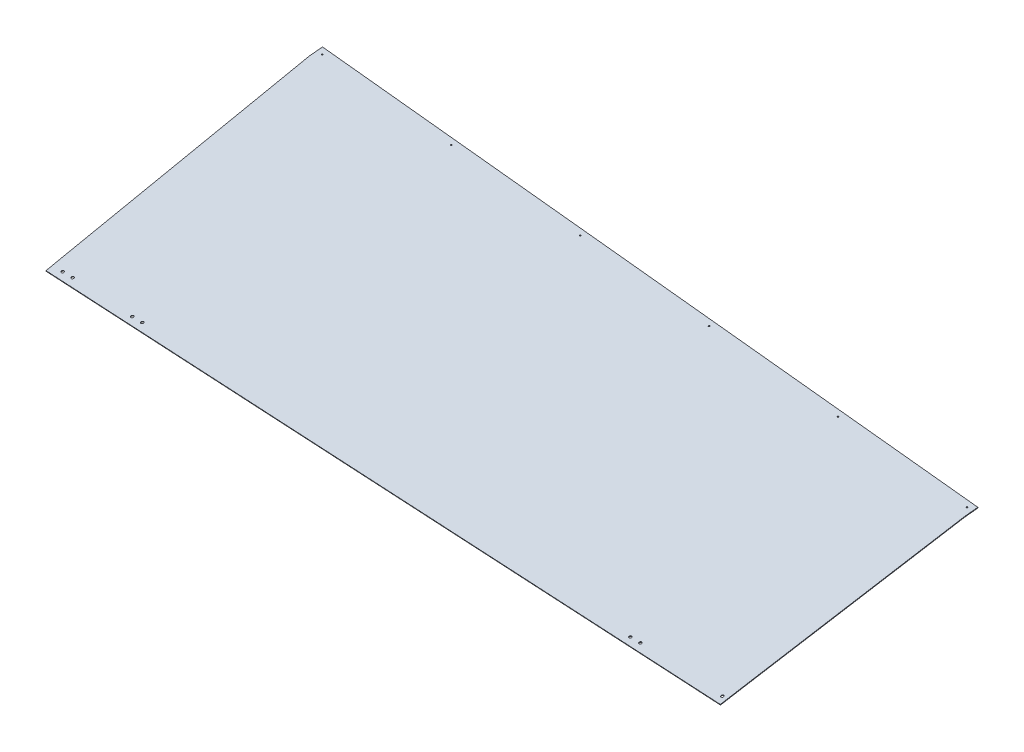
ISO-10303-21;
HEADER;
FILE_DESCRIPTION(('STEP AP214'),'2;1');
FILE_NAME('part.step','',(''),(''),'','','');
FILE_SCHEMA(('AUTOMOTIVE_DESIGN { 1 0 10303 214 1 1 1 1 }'));
ENDSEC;
DATA;
#1=APPLICATION_CONTEXT('core data for automotive mechanical design processes');
#2=APPLICATION_PROTOCOL_DEFINITION('international standard','automotive_design',2000,#1);
#3=PRODUCT_CONTEXT('',#1,'mechanical');
#4=PRODUCT('Part','Part','',(#3));
#5=PRODUCT_RELATED_PRODUCT_CATEGORY('part','',(#4));
#6=PRODUCT_DEFINITION_FORMATION('','',#4);
#7=PRODUCT_DEFINITION_CONTEXT('part definition',#1,'design');
#8=PRODUCT_DEFINITION('design','',#6,#7);
#9=PRODUCT_DEFINITION_SHAPE('','',#8);
#10=(LENGTH_UNIT() NAMED_UNIT(*) SI_UNIT(.MILLI.,.METRE.));
#11=(NAMED_UNIT(*) PLANE_ANGLE_UNIT() SI_UNIT($,.RADIAN.));
#12=(NAMED_UNIT(*) SI_UNIT($,.STERADIAN.) SOLID_ANGLE_UNIT());
#13=UNCERTAINTY_MEASURE_WITH_UNIT(LENGTH_MEASURE(1.E-05),#10,'distance_accuracy_value','');
#14=(GEOMETRIC_REPRESENTATION_CONTEXT(3) GLOBAL_UNCERTAINTY_ASSIGNED_CONTEXT((#13)) GLOBAL_UNIT_ASSIGNED_CONTEXT((#10,
#11,#12)) REPRESENTATION_CONTEXT('',''));
#15=CARTESIAN_POINT('',(0.,0.,0.));
#16=DIRECTION('',(0.,0.,1.));
#17=DIRECTION('',(1.,0.,0.));
#18=AXIS2_PLACEMENT_3D('',#15,#16,#17);
#19=CARTESIAN_POINT('',(6.04000777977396,-300.572395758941,-61.7927019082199));
#20=DIRECTION('',(-0.0196795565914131,0.979325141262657,0.201333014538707));
#21=DIRECTION('',(0.,-0.201372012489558,0.979514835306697));
#22=AXIS2_PLACEMENT_3D('',#19,#20,#21);
#23=PLANE('',#22);
#24=DIRECTION('',(0.,-0.201372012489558,0.979514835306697));
#25=VECTOR('',#24,1.);
#26=CARTESIAN_POINT('',(-2552.66800891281,-349.904673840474,-71.9346004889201));
#27=LINE('',#26,#25);
#28=CARTESIAN_POINT('',(-2552.66800891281,-38.36786149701,-1587.31365273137));
#29=VERTEX_POINT('',#28);
#30=CARTESIAN_POINT('',(-2552.66800891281,-161.607651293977,-987.849998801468));
#31=VERTEX_POINT('',#30);
#32=EDGE_CURVE('E168',#29,#31,#27,.T.);
#33=ORIENTED_EDGE('',*,*,#32,.F.);
#34=DIRECTION('',(-0.095271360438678,-0.202292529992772,0.974679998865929));
#35=VECTOR('',#34,1.);
#36=CARTESIAN_POINT('',(-2552.47657041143,-37.9613743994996,-1589.27217707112));
#37=LINE('',#36,#35);
#38=CARTESIAN_POINT('',(-2549.70400794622,-32.0743095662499,-1617.63706204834));
#39=VERTEX_POINT('',#38);
#40=EDGE_CURVE('E173',#39,#29,#37,.T.);
#41=ORIENTED_EDGE('',*,*,#40,.F.);
#42=DIRECTION('',(-0.995256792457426,0.,-0.0972826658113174));
#43=VECTOR('',#42,1.);
#44=CARTESIAN_POINT('',(-2549.86215064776,-32.0743095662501,-1617.65251991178));
#45=LINE('',#44,#43);
#46=CARTESIAN_POINT('',(-750.604234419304,-32.07430956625,-1441.78172164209));
#47=VERTEX_POINT('',#46);
#48=EDGE_CURVE('E688',#47,#39,#45,.T.);
#49=ORIENTED_EDGE('',*,*,#48,.F.);
#50=DIRECTION('',(0.0952713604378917,0.202292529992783,-0.974679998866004));
#51=VECTOR('',#50,1.);
#52=CARTESIAN_POINT('',(-753.44208377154,-38.1000000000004,-1412.7489148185));
#53=LINE('',#52,#51);
#54=CARTESIAN_POINT('',(-753.44208377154,-38.1000000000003,-1412.7489148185));
#55=VERTEX_POINT('',#54);
#56=EDGE_CURVE('E194',#55,#47,#53,.T.);
#57=ORIENTED_EDGE('',*,*,#56,.F.);
#58=DIRECTION('',(0.0340234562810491,0.201911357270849,-0.978812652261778));
#59=VECTOR('',#58,1.);
#60=CARTESIAN_POINT('',(-799.356363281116,-310.577152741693,-91.8520214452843));
#61=LINE('',#60,#59);
#62=CARTESIAN_POINT('',(-771.320620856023,-144.199734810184,-898.405570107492));
#63=VERTEX_POINT('',#62);
#64=EDGE_CURVE('E179',#63,#55,#61,.T.);
#65=ORIENTED_EDGE('',*,*,#64,.F.);
#66=DIRECTION('',(0.02768603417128,0.201828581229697,-0.979029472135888));
#67=VECTOR('',#66,1.);
#68=CARTESIAN_POINT('',(-771.337947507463,-144.326044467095,-897.79286760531));
#69=LINE('',#68,#67);
#70=CARTESIAN_POINT('',(-771.337947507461,-144.326044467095,-897.79286760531));
#71=VERTEX_POINT('',#70);
#72=EDGE_CURVE('E144',#71,#63,#69,.T.);
#73=ORIENTED_EDGE('',*,*,#72,.F.);
#74=DIRECTION('',(0.0312390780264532,0.201875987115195,-0.978912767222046));
#75=VECTOR('',#74,1.);
#76=CARTESIAN_POINT('',(-798.724837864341,-321.308077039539,-39.5928720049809));
#77=LINE('',#76,#75);
#78=CARTESIAN_POINT('',(-773.600317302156,-158.946134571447,-826.898884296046));
#79=VERTEX_POINT('',#78);
#80=EDGE_CURVE('E609',#79,#71,#77,.T.);
#81=ORIENTED_EDGE('',*,*,#80,.F.);
#82=DIRECTION('',(-0.998109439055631,-0.00751635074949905,-0.0610004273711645));
#83=VECTOR('',#82,1.);
#84=CARTESIAN_POINT('',(2449.4820662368,-134.674429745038,-629.917075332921));
#85=LINE('',#84,#83);
#86=CARTESIAN_POINT('',(-2552.49538074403,-172.342260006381,-935.617783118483));
#87=VERTEX_POINT('',#86);
#88=EDGE_CURVE('E716',#79,#87,#85,.T.);
#89=ORIENTED_EDGE('',*,*,#88,.T.);
#90=DIRECTION('',(0.0034465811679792,-0.201304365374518,0.979522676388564));
#91=VECTOR('',#90,1.);
#92=CARTESIAN_POINT('',(-2549.25021130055,-361.882776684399,-13.336570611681));
#93=LINE('',#92,#91);
#94=CARTESIAN_POINT('',(-2552.6770094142,-161.733879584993,-987.23687822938));
#95=VERTEX_POINT('',#94);
#96=EDGE_CURVE('E805',#95,#87,#93,.T.);
#97=ORIENTED_EDGE('',*,*,#96,.F.);
#98=DIRECTION('',(-0.0143767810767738,-0.201628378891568,0.979356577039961));
#99=VECTOR('',#98,1.);
#100=CARTESIAN_POINT('',(-2552.66800891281,-161.607651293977,-987.849998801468));
#101=LINE('',#100,#99);
#102=EDGE_CURVE('E178',#31,#95,#101,.T.);
#103=ORIENTED_EDGE('',*,*,#102,.F.);
#104=EDGE_LOOP('',(#33,#41,#49,#57,#65,#73,#81,#89,#97,#103));
#105=FACE_BOUND('',#104,.T.);
#106=CARTESIAN_POINT('',(-2536.35628306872,-34.6434246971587,-1603.83566761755));
#107=DIRECTION('',(0.019679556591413,-0.979325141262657,-0.201333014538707));
#108=DIRECTION('',(-0.995256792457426,0.,-0.0972826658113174));
#109=AXIS2_PLACEMENT_3D('',#106,#107,#108);
#110=CIRCLE('',#109,1.58749999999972);
#111=CARTESIAN_POINT('',(-2537.93625322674,-34.6434246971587,-1603.99010384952));
#112=VERTEX_POINT('',#111);
#113=EDGE_CURVE('E669',#112,#112,#110,.T.);
#114=ORIENTED_EDGE('',*,*,#113,.F.);
#115=EDGE_LOOP('',(#114));
#116=FACE_BOUND('',#115,.T.);
#117=CARTESIAN_POINT('',(-2182.44296767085,-34.6434246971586,-1569.24195165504));
#118=DIRECTION('',(0.019679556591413,-0.979325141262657,-0.201333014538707));
#119=DIRECTION('',(-0.995256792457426,0.,-0.0972826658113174));
#120=AXIS2_PLACEMENT_3D('',#117,#118,#119);
#121=CIRCLE('',#120,1.58750000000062);
#122=CARTESIAN_POINT('',(-2184.02293782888,-34.6434246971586,-1569.39638788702));
#123=VERTEX_POINT('',#122);
#124=EDGE_CURVE('E672',#123,#123,#121,.T.);
#125=ORIENTED_EDGE('',*,*,#124,.F.);
#126=EDGE_LOOP('',(#125));
#127=FACE_BOUND('',#126,.T.);
#128=CARTESIAN_POINT('',(-1828.52965227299,-34.6434246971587,-1534.64823569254));
#129=DIRECTION('',(0.019679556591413,-0.979325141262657,-0.201333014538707));
#130=DIRECTION('',(-0.995256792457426,0.,-0.0972826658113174));
#131=AXIS2_PLACEMENT_3D('',#128,#129,#130);
#132=CIRCLE('',#131,1.58750000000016);
#133=CARTESIAN_POINT('',(-1830.10962243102,-34.6434246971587,-1534.80267192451));
#134=VERTEX_POINT('',#133);
#135=EDGE_CURVE('E675',#134,#134,#132,.T.);
#136=ORIENTED_EDGE('',*,*,#135,.F.);
#137=EDGE_LOOP('',(#136));
#138=FACE_BOUND('',#137,.T.);
#139=CARTESIAN_POINT('',(-1474.61633687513,-34.6434246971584,-1500.05451973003));
#140=DIRECTION('',(0.019679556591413,-0.979325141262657,-0.201333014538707));
#141=DIRECTION('',(-0.995256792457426,0.,-0.0972826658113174));
#142=AXIS2_PLACEMENT_3D('',#139,#140,#141);
#143=CIRCLE('',#142,1.58749999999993);
#144=CARTESIAN_POINT('',(-1476.19630703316,-34.6434246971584,-1500.20895596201));
#145=VERTEX_POINT('',#144);
#146=EDGE_CURVE('E678',#145,#145,#143,.T.);
#147=ORIENTED_EDGE('',*,*,#146,.F.);
#148=EDGE_LOOP('',(#147));
#149=FACE_BOUND('',#148,.T.);
#150=CARTESIAN_POINT('',(-1120.70302147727,-34.6434246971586,-1465.46080376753));
#151=DIRECTION('',(0.019679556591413,-0.979325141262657,-0.201333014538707));
#152=DIRECTION('',(-0.995256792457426,0.,-0.0972826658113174));
#153=AXIS2_PLACEMENT_3D('',#150,#151,#152);
#154=CIRCLE('',#153,1.58749999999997);
#155=CARTESIAN_POINT('',(-1122.2829916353,-34.6434246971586,-1465.6152399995));
#156=VERTEX_POINT('',#155);
#157=EDGE_CURVE('E681',#156,#156,#154,.T.);
#158=ORIENTED_EDGE('',*,*,#157,.F.);
#159=EDGE_LOOP('',(#158));
#160=FACE_BOUND('',#159,.T.);
#161=CARTESIAN_POINT('',(-766.789706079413,-34.6434246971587,-1430.86708780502));
#162=DIRECTION('',(0.019679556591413,-0.979325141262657,-0.201333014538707));
#163=DIRECTION('',(-0.995256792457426,0.,-0.0972826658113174));
#164=AXIS2_PLACEMENT_3D('',#161,#162,#163);
#165=CIRCLE('',#164,1.58749999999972);
#166=CARTESIAN_POINT('',(-768.369676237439,-34.6434246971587,-1431.021524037));
#167=VERTEX_POINT('',#166);
#168=EDGE_CURVE('E684',#167,#167,#165,.T.);
#169=ORIENTED_EDGE('',*,*,#168,.F.);
#170=EDGE_LOOP('',(#169));
#171=FACE_BOUND('',#170,.T.);
#172=CARTESIAN_POINT('',(-2526.0839190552,-168.78263574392,-950.350904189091));
#173=DIRECTION('',(0.0196795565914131,-0.979325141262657,-0.201333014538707));
#174=DIRECTION('',(-0.00344658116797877,0.201304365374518,-0.979522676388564));
#175=AXIS2_PLACEMENT_3D('',#172,#173,#174);
#176=CIRCLE('',#175,3.17500000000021);
#177=CARTESIAN_POINT('',(-2526.09486195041,-168.143494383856,-953.460888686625));
#178=VERTEX_POINT('',#177);
#179=EDGE_CURVE('E720',#178,#178,#176,.T.);
#180=ORIENTED_EDGE('',*,*,#179,.F.);
#181=EDGE_LOOP('',(#180));
#182=FACE_BOUND('',#181,.T.);
#183=CARTESIAN_POINT('',(-2500.69926572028,-168.439778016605,-949.537378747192));
#184=DIRECTION('',(0.0196795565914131,-0.979325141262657,-0.201333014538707));
#185=DIRECTION('',(-0.00344658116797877,0.201304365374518,-0.979522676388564));
#186=AXIS2_PLACEMENT_3D('',#183,#184,#185);
#187=CIRCLE('',#186,3.17500000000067);
#188=CARTESIAN_POINT('',(-2500.71020861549,-167.80063665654,-952.647363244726));
#189=VERTEX_POINT('',#188);
#190=EDGE_CURVE('E730',#189,#189,#187,.T.);
#191=ORIENTED_EDGE('',*,*,#190,.F.);
#192=EDGE_LOOP('',(#191));
#193=FACE_BOUND('',#192,.T.);
#194=CARTESIAN_POINT('',(-2342.20762643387,-167.397941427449,-939.113115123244));
#195=DIRECTION('',(0.0196795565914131,-0.979325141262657,-0.201333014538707));
#196=DIRECTION('',(-0.00344658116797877,0.201304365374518,-0.979522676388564));
#197=AXIS2_PLACEMENT_3D('',#194,#195,#196);
#198=CIRCLE('',#197,3.17500000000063);
#199=CARTESIAN_POINT('',(-2342.21856932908,-166.758800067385,-942.223099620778));
#200=VERTEX_POINT('',#199);
#201=EDGE_CURVE('E736',#200,#200,#198,.T.);
#202=ORIENTED_EDGE('',*,*,#201,.F.);
#203=EDGE_LOOP('',(#202));
#204=FACE_BOUND('',#203,.T.);
#205=CARTESIAN_POINT('',(-2316.82297309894,-167.055083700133,-938.299589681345));
#206=DIRECTION('',(0.0196795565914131,-0.979325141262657,-0.201333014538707));
#207=DIRECTION('',(-0.00344658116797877,0.201304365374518,-0.979522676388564));
#208=AXIS2_PLACEMENT_3D('',#205,#206,#207);
#209=CIRCLE('',#208,3.17500000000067);
#210=CARTESIAN_POINT('',(-2316.83391599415,-166.415942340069,-941.409574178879));
#211=VERTEX_POINT('',#210);
#212=EDGE_CURVE('E742',#211,#211,#209,.T.);
#213=ORIENTED_EDGE('',*,*,#212,.F.);
#214=EDGE_LOOP('',(#213));
#215=FACE_BOUND('',#214,.T.);
#216=CARTESIAN_POINT('',(-1028.1261903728,-157.502151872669,-858.801674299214));
#217=DIRECTION('',(0.0196795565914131,-0.979325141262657,-0.201333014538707));
#218=DIRECTION('',(-0.00344658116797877,0.201304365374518,-0.979522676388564));
#219=AXIS2_PLACEMENT_3D('',#216,#217,#218);
#220=CIRCLE('',#219,3.17500000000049);
#221=CARTESIAN_POINT('',(-1028.137133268,-156.863010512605,-861.911658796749));
#222=VERTEX_POINT('',#221);
#223=EDGE_CURVE('E748',#222,#222,#220,.T.);
#224=ORIENTED_EDGE('',*,*,#223,.F.);
#225=EDGE_LOOP('',(#224));
#226=FACE_BOUND('',#225,.T.);
#227=CARTESIAN_POINT('',(-1002.74153703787,-157.159294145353,-857.988148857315));
#228=DIRECTION('',(0.0196795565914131,-0.979325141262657,-0.201333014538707));
#229=DIRECTION('',(-0.00344658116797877,0.201304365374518,-0.979522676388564));
#230=AXIS2_PLACEMENT_3D('',#227,#228,#229);
#231=CIRCLE('',#230,3.17500000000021);
#232=CARTESIAN_POINT('',(-1002.75247993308,-156.520152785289,-861.098133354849));
#233=VERTEX_POINT('',#232);
#234=EDGE_CURVE('E754',#233,#233,#231,.T.);
#235=ORIENTED_EDGE('',*,*,#234,.F.);
#236=EDGE_LOOP('',(#235));
#237=FACE_BOUND('',#236,.T.);
#238=CARTESIAN_POINT('',(-785.599700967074,-155.675787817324,-843.97941803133));
#239=DIRECTION('',(0.0196795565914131,-0.979325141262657,-0.201333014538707));
#240=DIRECTION('',(-0.00344658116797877,0.201304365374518,-0.979522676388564));
#241=AXIS2_PLACEMENT_3D('',#238,#239,#240);
#242=CIRCLE('',#241,3.17500000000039);
#243=CARTESIAN_POINT('',(-785.610643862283,-155.03664645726,-847.089402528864));
#244=VERTEX_POINT('',#243);
#245=EDGE_CURVE('E760',#244,#244,#242,.T.);
#246=ORIENTED_EDGE('',*,*,#245,.F.);
#247=EDGE_LOOP('',(#246));
#248=FACE_BOUND('',#247,.T.);
#249=ADVANCED_FACE('F127',(#105,#116,#127,#138,#149,#160,#171,#182,#193,#204,#215,#226,#237,
#248),#23,.F.);
#250=CARTESIAN_POINT('',(-875.350545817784,3471.16524588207,685.611524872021));
#251=DIRECTION('',(-0.999227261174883,-0.0124125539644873,-0.037293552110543));
#252=DIRECTION('',(-0.0372964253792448,0.,0.999304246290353));
#253=AXIS2_PLACEMENT_3D('',#250,#251,#252);
#254=PLANE('',#253);
#255=CARTESIAN_POINT('',(-771.320620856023,-144.199734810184,-898.405570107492));
#256=DIRECTION('',(-0.019679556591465,0.979325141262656,0.201333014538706));
#257=VECTOR('',#256,1.);
#258=LINE('',#255,#257);
#259=CARTESIAN_POINT('',(-771.352611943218,-142.607743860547,-898.078283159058));
#260=VERTEX_POINT('',#259);
#261=EDGE_CURVE('E13',#63,#260,#258,.T.);
#262=ORIENTED_EDGE('',*,*,#261,.F.);
#263=ORIENTED_EDGE('',*,*,#64,.T.);
#264=DIRECTION('',(-0.0196795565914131,0.979325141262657,0.201333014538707));
#265=VECTOR('',#264,1.);
#266=CARTESIAN_POINT('',(-753.458079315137,-37.304004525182,-1412.58527134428));
#267=LINE('',#266,#265);
#268=CARTESIAN_POINT('',(-753.474074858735,-36.5080090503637,-1412.42162787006));
#269=VERTEX_POINT('',#268);
#270=EDGE_CURVE('E186',#55,#269,#267,.T.);
#271=ORIENTED_EDGE('',*,*,#270,.T.);
#272=DIRECTION('',(0.0340234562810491,0.201911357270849,-0.978812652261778));
#273=VECTOR('',#272,1.);
#274=CARTESIAN_POINT('',(-799.388354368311,-308.985161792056,-91.5247344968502));
#275=LINE('',#274,#273);
#276=EDGE_CURVE('E214',#260,#269,#275,.T.);
#277=ORIENTED_EDGE('',*,*,#276,.F.);
#278=EDGE_LOOP('',(#262,#263,#271,#277));
#279=FACE_BOUND('',#278,.T.);
#280=ADVANCED_FACE('F216',(#279),#254,.F.);
#281=CARTESIAN_POINT('',(-2628.66219144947,3431.83772478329,705.528945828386));
#282=DIRECTION('',(0.999806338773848,0.0192764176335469,0.00396291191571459));
#283=DIRECTION('',(-0.0192765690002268,0.999814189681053,0.));
#284=AXIS2_PLACEMENT_3D('',#281,#282,#283);
#285=PLANE('',#284);
#286=DIRECTION('',(0.,-0.201372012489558,0.979514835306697));
#287=VECTOR('',#286,1.);
#288=CARTESIAN_POINT('',(-2552.7,-348.312682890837,-71.6073135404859));
#289=LINE('',#288,#287);
#290=CARTESIAN_POINT('',(-2552.7,-36.7758705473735,-1586.98636578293));
#291=VERTEX_POINT('',#290);
#292=CARTESIAN_POINT('',(-2552.7,-160.01566034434,-987.522711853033));
#293=VERTEX_POINT('',#292);
#294=EDGE_CURVE('E153',#291,#293,#289,.T.);
#295=ORIENTED_EDGE('',*,*,#294,.F.);
#296=DIRECTION('',(-0.0196795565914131,0.979325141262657,0.201333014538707));
#297=VECTOR('',#296,1.);
#298=CARTESIAN_POINT('',(-2552.6840044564,-37.5718660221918,-1587.15000925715));
#299=LINE('',#298,#297);
#300=EDGE_CURVE('E181',#29,#291,#299,.T.);
#301=ORIENTED_EDGE('',*,*,#300,.F.);
#302=ORIENTED_EDGE('',*,*,#32,.T.);
#303=CARTESIAN_POINT('',(-2552.66800891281,-161.607651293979,-987.849998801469));
#304=DIRECTION('',(-0.0196795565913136,0.979325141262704,0.201333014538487));
#305=VECTOR('',#304,1.);
#306=LINE('',#303,#305);
#307=EDGE_CURVE('E138',#31,#293,#306,.T.);
#308=ORIENTED_EDGE('',*,*,#307,.T.);
#309=EDGE_LOOP('',(#295,#301,#302,#308));
#310=FACE_BOUND('',#309,.T.);
#311=ADVANCED_FACE('F182',(#310),#285,.F.);
#312=CARTESIAN_POINT('',(6.00801669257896,-298.980404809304,-61.4654149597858));
#313=DIRECTION('',(-0.0196795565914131,0.979325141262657,0.201333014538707));
#314=DIRECTION('',(0.,-0.201372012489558,0.979514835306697));
#315=AXIS2_PLACEMENT_3D('',#312,#313,#314);
#316=PLANE('',#315);
#317=ORIENTED_EDGE('',*,*,#276,.T.);
#318=DIRECTION('',(0.0952713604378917,0.202292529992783,-0.974679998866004));
#319=VECTOR('',#318,1.);
#320=CARTESIAN_POINT('',(-753.474074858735,-36.5080090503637,-1412.42162787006));
#321=LINE('',#320,#319);
#322=CARTESIAN_POINT('',(-750.636225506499,-30.4823186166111,-1441.45443469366));
#323=VERTEX_POINT('',#322);
#324=EDGE_CURVE('E193',#269,#323,#321,.T.);
#325=ORIENTED_EDGE('',*,*,#324,.T.);
#326=DIRECTION('',(-0.995256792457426,0.,-0.0972826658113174));
#327=VECTOR('',#326,1.);
#328=CARTESIAN_POINT('',(132.459438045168,-30.4823186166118,-1355.13510387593));
#329=LINE('',#328,#327);
#330=CARTESIAN_POINT('',(-2549.73599903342,-30.4823186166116,-1617.30977509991));
#331=VERTEX_POINT('',#330);
#332=EDGE_CURVE('E646',#323,#331,#329,.T.);
#333=ORIENTED_EDGE('',*,*,#332,.T.);
#334=DIRECTION('',(-0.095271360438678,-0.202292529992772,0.974679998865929));
#335=VECTOR('',#334,1.);
#336=CARTESIAN_POINT('',(-2552.50856149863,-36.3693834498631,-1588.94489012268));
#337=LINE('',#336,#335);
#338=EDGE_CURVE('E187',#331,#291,#337,.T.);
#339=ORIENTED_EDGE('',*,*,#338,.T.);
#340=ORIENTED_EDGE('',*,*,#294,.T.);
#341=DIRECTION('',(-0.0143767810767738,-0.201628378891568,0.979356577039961));
#342=VECTOR('',#341,1.);
#343=CARTESIAN_POINT('',(-2552.7,-160.01566034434,-987.522711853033));
#344=LINE('',#343,#342);
#345=CARTESIAN_POINT('',(-2552.7090005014,-160.141888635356,-986.909591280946));
#346=VERTEX_POINT('',#345);
#347=EDGE_CURVE('E243',#293,#346,#344,.T.);
#348=ORIENTED_EDGE('',*,*,#347,.T.);
#349=DIRECTION('',(0.0034465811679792,-0.201304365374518,0.979522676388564));
#350=VECTOR('',#349,1.);
#351=CARTESIAN_POINT('',(-2549.28220238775,-360.290785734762,-13.0092836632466));
#352=LINE('',#351,#350);
#353=CARTESIAN_POINT('',(-2552.52737183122,-170.750269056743,-935.290496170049));
#354=VERTEX_POINT('',#353);
#355=EDGE_CURVE('E711',#346,#354,#352,.T.);
#356=ORIENTED_EDGE('',*,*,#355,.T.);
#357=DIRECTION('',(-0.998109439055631,-0.00751635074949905,-0.0610004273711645));
#358=VECTOR('',#357,1.);
#359=CARTESIAN_POINT('',(2449.4500751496,-133.082438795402,-629.589788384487));
#360=LINE('',#359,#358);
#361=CARTESIAN_POINT('',(-773.632308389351,-157.35414362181,-826.571597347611));
#362=VERTEX_POINT('',#361);
#363=EDGE_CURVE('E714',#362,#354,#360,.T.);
#364=ORIENTED_EDGE('',*,*,#363,.F.);
#365=DIRECTION('',(0.0312390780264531,0.201875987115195,-0.978912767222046));
#366=VECTOR('',#365,1.);
#367=CARTESIAN_POINT('',(-798.756828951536,-319.716086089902,-39.2655850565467));
#368=LINE('',#367,#366);
#369=CARTESIAN_POINT('',(-771.369938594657,-142.734053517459,-897.465580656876));
#370=VERTEX_POINT('',#369);
#371=EDGE_CURVE('E707',#362,#370,#368,.T.);
#372=ORIENTED_EDGE('',*,*,#371,.T.);
#373=DIRECTION('',(0.02768603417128,0.201828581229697,-0.979029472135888));
#374=VECTOR('',#373,1.);
#375=CARTESIAN_POINT('',(-771.369938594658,-142.734053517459,-897.465580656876));
#376=LINE('',#375,#374);
#377=EDGE_CURVE('E253',#370,#260,#376,.T.);
#378=ORIENTED_EDGE('',*,*,#377,.T.);
#379=EDGE_LOOP('',(#317,#325,#333,#339,#340,#348,#356,#364,#372,#378));
#380=FACE_BOUND('',#379,.T.);
#381=CARTESIAN_POINT('',(-2536.38827415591,-33.05143374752,-1603.50838066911));
#382=DIRECTION('',(0.019679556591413,-0.979325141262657,-0.201333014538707));
#383=DIRECTION('',(-0.995256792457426,0.,-0.0972826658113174));
#384=AXIS2_PLACEMENT_3D('',#381,#382,#383);
#385=CIRCLE('',#384,1.58749999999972);
#386=CARTESIAN_POINT('',(-2537.96824431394,-33.05143374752,-1603.66281690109));
#387=VERTEX_POINT('',#386);
#388=EDGE_CURVE('E666',#387,#387,#385,.T.);
#389=ORIENTED_EDGE('',*,*,#388,.T.);
#390=EDGE_LOOP('',(#389));
#391=FACE_BOUND('',#390,.T.);
#392=CARTESIAN_POINT('',(-2182.47495875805,-33.0514337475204,-1568.91466470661));
#393=DIRECTION('',(0.019679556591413,-0.979325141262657,-0.201333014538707));
#394=DIRECTION('',(-0.995256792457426,0.,-0.0972826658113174));
#395=AXIS2_PLACEMENT_3D('',#392,#393,#394);
#396=CIRCLE('',#395,1.58750000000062);
#397=CARTESIAN_POINT('',(-2184.05492891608,-33.0514337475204,-1569.06910093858));
#398=VERTEX_POINT('',#397);
#399=EDGE_CURVE('E663',#398,#398,#396,.T.);
#400=ORIENTED_EDGE('',*,*,#399,.T.);
#401=EDGE_LOOP('',(#400));
#402=FACE_BOUND('',#401,.T.);
#403=CARTESIAN_POINT('',(-1828.56164336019,-33.0514337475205,-1534.3209487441));
#404=DIRECTION('',(0.019679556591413,-0.979325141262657,-0.201333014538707));
#405=DIRECTION('',(-0.995256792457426,0.,-0.0972826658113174));
#406=AXIS2_PLACEMENT_3D('',#403,#404,#405);
#407=CIRCLE('',#406,1.58750000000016);
#408=CARTESIAN_POINT('',(-1830.14161351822,-33.0514337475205,-1534.47538497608));
#409=VERTEX_POINT('',#408);
#410=EDGE_CURVE('E660',#409,#409,#407,.T.);
#411=ORIENTED_EDGE('',*,*,#410,.T.);
#412=EDGE_LOOP('',(#411));
#413=FACE_BOUND('',#412,.T.);
#414=CARTESIAN_POINT('',(-1474.64832796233,-33.0514337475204,-1499.7272327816));
#415=DIRECTION('',(0.019679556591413,-0.979325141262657,-0.201333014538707));
#416=DIRECTION('',(-0.995256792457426,0.,-0.0972826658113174));
#417=AXIS2_PLACEMENT_3D('',#414,#415,#416);
#418=CIRCLE('',#417,1.58749999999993);
#419=CARTESIAN_POINT('',(-1476.22829812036,-33.0514337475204,-1499.88166901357));
#420=VERTEX_POINT('',#419);
#421=EDGE_CURVE('E657',#420,#420,#418,.T.);
#422=ORIENTED_EDGE('',*,*,#421,.T.);
#423=EDGE_LOOP('',(#422));
#424=FACE_BOUND('',#423,.T.);
#425=CARTESIAN_POINT('',(-1120.73501256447,-33.0514337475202,-1465.13351681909));
#426=DIRECTION('',(0.019679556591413,-0.979325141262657,-0.201333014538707));
#427=DIRECTION('',(-0.995256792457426,0.,-0.0972826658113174));
#428=AXIS2_PLACEMENT_3D('',#425,#426,#427);
#429=CIRCLE('',#428,1.58749999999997);
#430=CARTESIAN_POINT('',(-1122.31498272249,-33.0514337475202,-1465.28795305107));
#431=VERTEX_POINT('',#430);
#432=EDGE_CURVE('E651',#431,#431,#429,.T.);
#433=ORIENTED_EDGE('',*,*,#432,.T.);
#434=EDGE_LOOP('',(#433));
#435=FACE_BOUND('',#434,.T.);
#436=CARTESIAN_POINT('',(-766.821697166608,-33.05143374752,-1430.53980085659));
#437=DIRECTION('',(0.019679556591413,-0.979325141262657,-0.201333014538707));
#438=DIRECTION('',(-0.995256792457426,0.,-0.0972826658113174));
#439=AXIS2_PLACEMENT_3D('',#436,#437,#438);
#440=CIRCLE('',#439,1.58749999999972);
#441=CARTESIAN_POINT('',(-768.401667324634,-33.05143374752,-1430.69423708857));
#442=VERTEX_POINT('',#441);
#443=EDGE_CURVE('E647',#442,#442,#440,.T.);
#444=ORIENTED_EDGE('',*,*,#443,.T.);
#445=EDGE_LOOP('',(#444));
#446=FACE_BOUND('',#445,.T.);
#447=CARTESIAN_POINT('',(-2526.1159101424,-167.190644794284,-950.023617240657));
#448=DIRECTION('',(-0.0196795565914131,0.979325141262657,0.201333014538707));
#449=DIRECTION('',(0.00344658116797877,-0.201304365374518,0.979522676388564));
#450=AXIS2_PLACEMENT_3D('',#447,#448,#449);
#451=CIRCLE('',#450,3.17500000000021);
#452=CARTESIAN_POINT('',(-2526.10496724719,-167.829786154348,-946.913632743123));
#453=VERTEX_POINT('',#452);
#454=EDGE_CURVE('E724',#453,#453,#451,.T.);
#455=ORIENTED_EDGE('',*,*,#454,.F.);
#456=EDGE_LOOP('',(#455));
#457=FACE_BOUND('',#456,.T.);
#458=CARTESIAN_POINT('',(-2500.73125680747,-166.847787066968,-949.210091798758));
#459=DIRECTION('',(-0.0196795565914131,0.979325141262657,0.201333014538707));
#460=DIRECTION('',(0.00344658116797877,-0.201304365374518,0.979522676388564));
#461=AXIS2_PLACEMENT_3D('',#458,#459,#460);
#462=CIRCLE('',#461,3.17500000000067);
#463=CARTESIAN_POINT('',(-2500.72031391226,-167.486928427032,-946.100107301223));
#464=VERTEX_POINT('',#463);
#465=EDGE_CURVE('E733',#464,#464,#462,.T.);
#466=ORIENTED_EDGE('',*,*,#465,.F.);
#467=EDGE_LOOP('',(#466));
#468=FACE_BOUND('',#467,.T.);
#469=CARTESIAN_POINT('',(-2342.23961752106,-165.805950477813,-938.78582817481));
#470=DIRECTION('',(-0.0196795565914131,0.979325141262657,0.201333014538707));
#471=DIRECTION('',(0.00344658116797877,-0.201304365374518,0.979522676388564));
#472=AXIS2_PLACEMENT_3D('',#469,#470,#471);
#473=CIRCLE('',#472,3.17500000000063);
#474=CARTESIAN_POINT('',(-2342.22867462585,-166.445091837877,-935.675843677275));
#475=VERTEX_POINT('',#474);
#476=EDGE_CURVE('E739',#475,#475,#473,.T.);
#477=ORIENTED_EDGE('',*,*,#476,.F.);
#478=EDGE_LOOP('',(#477));
#479=FACE_BOUND('',#478,.T.);
#480=CARTESIAN_POINT('',(-2316.85496418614,-165.463092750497,-937.972302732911));
#481=DIRECTION('',(-0.0196795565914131,0.979325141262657,0.201333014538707));
#482=DIRECTION('',(0.00344658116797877,-0.201304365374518,0.979522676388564));
#483=AXIS2_PLACEMENT_3D('',#480,#481,#482);
#484=CIRCLE('',#483,3.17500000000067);
#485=CARTESIAN_POINT('',(-2316.84402129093,-166.102234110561,-934.862318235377));
#486=VERTEX_POINT('',#485);
#487=EDGE_CURVE('E745',#486,#486,#484,.T.);
#488=ORIENTED_EDGE('',*,*,#487,.F.);
#489=EDGE_LOOP('',(#488));
#490=FACE_BOUND('',#489,.T.);
#491=CARTESIAN_POINT('',(-1028.15818145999,-155.910160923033,-858.47438735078));
#492=DIRECTION('',(-0.0196795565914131,0.979325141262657,0.201333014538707));
#493=DIRECTION('',(0.00344658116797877,-0.201304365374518,0.979522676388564));
#494=AXIS2_PLACEMENT_3D('',#491,#492,#493);
#495=CIRCLE('',#494,3.17500000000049);
#496=CARTESIAN_POINT('',(-1028.14723856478,-156.549302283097,-855.364402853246));
#497=VERTEX_POINT('',#496);
#498=EDGE_CURVE('E751',#497,#497,#495,.T.);
#499=ORIENTED_EDGE('',*,*,#498,.F.);
#500=EDGE_LOOP('',(#499));
#501=FACE_BOUND('',#500,.T.);
#502=CARTESIAN_POINT('',(-1002.77352812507,-155.567303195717,-857.660861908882));
#503=DIRECTION('',(-0.0196795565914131,0.979325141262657,0.201333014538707));
#504=DIRECTION('',(0.00344658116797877,-0.201304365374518,0.979522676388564));
#505=AXIS2_PLACEMENT_3D('',#502,#503,#504);
#506=CIRCLE('',#505,3.17500000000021);
#507=CARTESIAN_POINT('',(-1002.76258522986,-156.206444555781,-854.550877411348));
#508=VERTEX_POINT('',#507);
#509=EDGE_CURVE('E757',#508,#508,#506,.T.);
#510=ORIENTED_EDGE('',*,*,#509,.F.);
#511=EDGE_LOOP('',(#510));
#512=FACE_BOUND('',#511,.T.);
#513=CARTESIAN_POINT('',(-785.631692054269,-154.083796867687,-843.652131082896));
#514=DIRECTION('',(-0.0196795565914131,0.979325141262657,0.201333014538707));
#515=DIRECTION('',(0.00344658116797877,-0.201304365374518,0.979522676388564));
#516=AXIS2_PLACEMENT_3D('',#513,#514,#515);
#517=CIRCLE('',#516,3.17500000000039);
#518=CARTESIAN_POINT('',(-785.620749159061,-154.722938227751,-840.542146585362));
#519=VERTEX_POINT('',#518);
#520=EDGE_CURVE('E631',#519,#519,#517,.T.);
#521=ORIENTED_EDGE('',*,*,#520,.F.);
#522=EDGE_LOOP('',(#521));
#523=FACE_BOUND('',#522,.T.);
#524=ADVANCED_FACE('F129',(#380,#391,#402,#413,#424,#435,#446,#457,#468,#479,#490,#501,#512,
#523),#316,.T.);
#525=CARTESIAN_POINT('',(-753.458079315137,-37.304004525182,-1412.58527134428));
#526=DIRECTION('',(0.995256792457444,0.,0.0972826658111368));
#527=DIRECTION('',(0.0952713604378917,0.202292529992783,-0.974679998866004));
#528=AXIS2_PLACEMENT_3D('',#525,#526,#527);
#529=PLANE('',#528);
#530=ORIENTED_EDGE('',*,*,#270,.F.);
#531=ORIENTED_EDGE('',*,*,#56,.T.);
#532=DIRECTION('',(0.0196795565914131,-0.979325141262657,-0.201333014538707));
#533=VECTOR('',#532,1.);
#534=CARTESIAN_POINT('',(-822.010745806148,3521.36915986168,-711.252650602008));
#535=LINE('',#534,#533);
#536=EDGE_CURVE('E642',#323,#47,#535,.T.);
#537=ORIENTED_EDGE('',*,*,#536,.F.);
#538=ORIENTED_EDGE('',*,*,#324,.F.);
#539=EDGE_LOOP('',(#530,#531,#537,#538));
#540=FACE_BOUND('',#539,.T.);
#541=ADVANCED_FACE('F299',(#540),#529,.T.);
#542=CARTESIAN_POINT('',(-2552.49256595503,-37.1653789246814,-1589.1085335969));
#543=DIRECTION('',(-0.995256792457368,1.22246106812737E-13,-0.0972826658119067));
#544=DIRECTION('',(-0.095271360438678,-0.202292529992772,0.974679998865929));
#545=AXIS2_PLACEMENT_3D('',#542,#543,#544);
#546=PLANE('',#545);
#547=ORIENTED_EDGE('',*,*,#338,.F.);
#548=DIRECTION('',(0.0196795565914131,-0.979325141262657,-0.201333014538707));
#549=VECTOR('',#548,1.);
#550=CARTESIAN_POINT('',(-2621.11051933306,3521.36915986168,-887.107991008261));
#551=LINE('',#550,#549);
#552=EDGE_CURVE('E192',#331,#39,#551,.T.);
#553=ORIENTED_EDGE('',*,*,#552,.T.);
#554=ORIENTED_EDGE('',*,*,#40,.T.);
#555=ORIENTED_EDGE('',*,*,#300,.T.);
#556=EDGE_LOOP('',(#547,#553,#554,#555));
#557=FACE_BOUND('',#556,.T.);
#558=ADVANCED_FACE('F190',(#557),#546,.T.);
#559=CARTESIAN_POINT('',(61.0849177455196,3521.36915986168,-624.933319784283));
#560=DIRECTION('',(-0.0952713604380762,-0.202292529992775,0.974679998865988));
#561=DIRECTION('',(0.,-0.979133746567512,-0.203216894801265));
#562=AXIS2_PLACEMENT_3D('',#559,#560,#561);
#563=PLANE('',#562);
#564=ORIENTED_EDGE('',*,*,#48,.T.);
#565=ORIENTED_EDGE('',*,*,#552,.F.);
#566=ORIENTED_EDGE('',*,*,#332,.F.);
#567=ORIENTED_EDGE('',*,*,#536,.T.);
#568=EDGE_LOOP('',(#564,#565,#566,#567));
#569=FACE_BOUND('',#568,.T.);
#570=ADVANCED_FACE('F269',(#569),#563,.F.);
#571=CARTESIAN_POINT('',(-766.839692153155,-32.1559388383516,-1430.3557019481));
#572=DIRECTION('',(0.019679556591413,-0.979325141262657,-0.201333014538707));
#573=DIRECTION('',(-0.995256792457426,0.,-0.0972826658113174));
#574=AXIS2_PLACEMENT_3D('',#571,#572,#573);
#575=CYLINDRICAL_SURFACE('',#574,1.58749999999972);
#576=ORIENTED_EDGE('',*,*,#168,.T.);
#577=EDGE_LOOP('',(#576));
#578=FACE_BOUND('',#577,.T.);
#579=ORIENTED_EDGE('',*,*,#443,.F.);
#580=EDGE_LOOP('',(#579));
#581=FACE_BOUND('',#580,.T.);
#582=ADVANCED_FACE('F273',(#578,#581),#575,.F.);
#583=CARTESIAN_POINT('',(-1120.75300755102,-32.1559388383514,-1464.9494179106));
#584=DIRECTION('',(0.019679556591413,-0.979325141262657,-0.201333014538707));
#585=DIRECTION('',(-0.995256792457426,0.,-0.0972826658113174));
#586=AXIS2_PLACEMENT_3D('',#583,#584,#585);
#587=CYLINDRICAL_SURFACE('',#586,1.58749999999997);
#588=ORIENTED_EDGE('',*,*,#157,.T.);
#589=EDGE_LOOP('',(#588));
#590=FACE_BOUND('',#589,.T.);
#591=ORIENTED_EDGE('',*,*,#432,.F.);
#592=EDGE_LOOP('',(#591));
#593=FACE_BOUND('',#592,.T.);
#594=ADVANCED_FACE('F277',(#590,#593),#587,.F.);
#595=CARTESIAN_POINT('',(-1474.66632294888,-32.1559388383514,-1499.5431338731));
#596=DIRECTION('',(0.019679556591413,-0.979325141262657,-0.201333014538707));
#597=DIRECTION('',(-0.995256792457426,0.,-0.0972826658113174));
#598=AXIS2_PLACEMENT_3D('',#595,#596,#597);
#599=CYLINDRICAL_SURFACE('',#598,1.58749999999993);
#600=ORIENTED_EDGE('',*,*,#146,.T.);
#601=EDGE_LOOP('',(#600));
#602=FACE_BOUND('',#601,.T.);
#603=ORIENTED_EDGE('',*,*,#421,.F.);
#604=EDGE_LOOP('',(#603));
#605=FACE_BOUND('',#604,.T.);
#606=ADVANCED_FACE('F281',(#602,#605),#599,.F.);
#607=CARTESIAN_POINT('',(-1828.57963834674,-32.1559388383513,-1534.13684983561));
#608=DIRECTION('',(0.019679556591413,-0.979325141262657,-0.201333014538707));
#609=DIRECTION('',(-0.995256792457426,0.,-0.0972826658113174));
#610=AXIS2_PLACEMENT_3D('',#607,#608,#609);
#611=CYLINDRICAL_SURFACE('',#610,1.58750000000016);
#612=ORIENTED_EDGE('',*,*,#135,.T.);
#613=EDGE_LOOP('',(#612));
#614=FACE_BOUND('',#613,.T.);
#615=ORIENTED_EDGE('',*,*,#410,.F.);
#616=EDGE_LOOP('',(#615));
#617=FACE_BOUND('',#616,.T.);
#618=ADVANCED_FACE('F285',(#614,#617),#611,.F.);
#619=CARTESIAN_POINT('',(-2182.4929537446,-32.1559388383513,-1568.73056579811));
#620=DIRECTION('',(0.019679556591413,-0.979325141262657,-0.201333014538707));
#621=DIRECTION('',(-0.995256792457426,0.,-0.0972826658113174));
#622=AXIS2_PLACEMENT_3D('',#619,#620,#621);
#623=CYLINDRICAL_SURFACE('',#622,1.58750000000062);
#624=ORIENTED_EDGE('',*,*,#124,.T.);
#625=EDGE_LOOP('',(#624));
#626=FACE_BOUND('',#625,.T.);
#627=ORIENTED_EDGE('',*,*,#399,.F.);
#628=EDGE_LOOP('',(#627));
#629=FACE_BOUND('',#628,.T.);
#630=ADVANCED_FACE('F289',(#626,#629),#623,.F.);
#631=CARTESIAN_POINT('',(-2536.40626914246,-32.1559388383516,-1603.32428176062));
#632=DIRECTION('',(0.019679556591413,-0.979325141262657,-0.201333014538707));
#633=DIRECTION('',(-0.995256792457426,0.,-0.0972826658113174));
#634=AXIS2_PLACEMENT_3D('',#631,#632,#633);
#635=CYLINDRICAL_SURFACE('',#634,1.58749999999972);
#636=ORIENTED_EDGE('',*,*,#113,.T.);
#637=EDGE_LOOP('',(#636));
#638=FACE_BOUND('',#637,.T.);
#639=ORIENTED_EDGE('',*,*,#388,.F.);
#640=EDGE_LOOP('',(#639));
#641=FACE_BOUND('',#640,.T.);
#642=ADVANCED_FACE('F293',(#638,#641),#635,.F.);
#643=CARTESIAN_POINT('',(-2552.6840044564,-160.811655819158,-987.686355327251));
#644=DIRECTION('',(-0.999702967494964,-0.0163787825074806,-0.0180475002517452));
#645=DIRECTION('',(-0.0143767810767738,-0.201628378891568,0.979356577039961));
#646=AXIS2_PLACEMENT_3D('',#643,#644,#645);
#647=PLANE('',#646);
#648=ORIENTED_EDGE('',*,*,#307,.F.);
#649=ORIENTED_EDGE('',*,*,#102,.T.);
#650=CARTESIAN_POINT('',(-2552.6770094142,-161.733879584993,-987.23687822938));
#651=DIRECTION('',(-0.0196795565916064,0.979325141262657,0.201333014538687));
#652=VECTOR('',#651,1.);
#653=LINE('',#650,#652);
#654=EDGE_CURVE('E615',#95,#346,#653,.T.);
#655=ORIENTED_EDGE('',*,*,#654,.T.);
#656=ORIENTED_EDGE('',*,*,#347,.F.);
#657=EDGE_LOOP('',(#648,#649,#655,#656));
#658=FACE_BOUND('',#657,.T.);
#659=ADVANCED_FACE('F266',(#658),#647,.T.);
#660=CARTESIAN_POINT('',(-771.35394305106,-143.530048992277,-897.629224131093));
#661=DIRECTION('',(0.999422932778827,0.013692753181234,0.0310855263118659));
#662=DIRECTION('',(0.02768603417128,0.201828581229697,-0.979029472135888));
#663=AXIS2_PLACEMENT_3D('',#660,#661,#662);
#664=PLANE('',#663);
#665=ORIENTED_EDGE('',*,*,#72,.T.);
#666=ORIENTED_EDGE('',*,*,#261,.T.);
#667=ORIENTED_EDGE('',*,*,#377,.F.);
#668=CARTESIAN_POINT('',(-771.337947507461,-144.326044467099,-897.79286760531));
#669=DIRECTION('',(-0.0196795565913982,0.979325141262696,0.201333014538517));
#670=VECTOR('',#669,1.);
#671=LINE('',#668,#670);
#672=EDGE_CURVE('E625',#71,#370,#671,.T.);
#673=ORIENTED_EDGE('',*,*,#672,.F.);
#674=EDGE_LOOP('',(#665,#666,#667,#673));
#675=FACE_BOUND('',#674,.T.);
#676=ADVANCED_FACE('F255',(#675),#664,.T.);
#677=CARTESIAN_POINT('',(-785.649687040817,-153.188301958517,-843.468032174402));
#678=DIRECTION('',(0.0196795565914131,-0.979325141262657,-0.201333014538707));
#679=DIRECTION('',(-0.00344658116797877,0.201304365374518,-0.979522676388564));
#680=AXIS2_PLACEMENT_3D('',#677,#678,#679);
#681=CYLINDRICAL_SURFACE('',#680,3.17500000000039);
#682=ORIENTED_EDGE('',*,*,#520,.T.);
#683=EDGE_LOOP('',(#682));
#684=FACE_BOUND('',#683,.T.);
#685=ORIENTED_EDGE('',*,*,#245,.T.);
#686=EDGE_LOOP('',(#685));
#687=FACE_BOUND('',#686,.T.);
#688=ADVANCED_FACE('F265',(#684,#687),#681,.F.);
#689=CARTESIAN_POINT('',(-1002.79152311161,-154.671808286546,-857.476763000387));
#690=DIRECTION('',(0.0196795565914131,-0.979325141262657,-0.201333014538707));
#691=DIRECTION('',(-0.00344658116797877,0.201304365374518,-0.979522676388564));
#692=AXIS2_PLACEMENT_3D('',#689,#690,#691);
#693=CYLINDRICAL_SURFACE('',#692,3.17500000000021);
#694=ORIENTED_EDGE('',*,*,#509,.T.);
#695=EDGE_LOOP('',(#694));
#696=FACE_BOUND('',#695,.T.);
#697=ORIENTED_EDGE('',*,*,#234,.T.);
#698=EDGE_LOOP('',(#697));
#699=FACE_BOUND('',#698,.T.);
#700=ADVANCED_FACE('F463',(#696,#699),#693,.F.);
#701=CARTESIAN_POINT('',(-1028.17617644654,-155.014666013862,-858.290288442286));
#702=DIRECTION('',(0.0196795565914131,-0.979325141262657,-0.201333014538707));
#703=DIRECTION('',(-0.00344658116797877,0.201304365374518,-0.979522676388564));
#704=AXIS2_PLACEMENT_3D('',#701,#702,#703);
#705=CYLINDRICAL_SURFACE('',#704,3.17500000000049);
#706=ORIENTED_EDGE('',*,*,#498,.T.);
#707=EDGE_LOOP('',(#706));
#708=FACE_BOUND('',#707,.T.);
#709=ORIENTED_EDGE('',*,*,#223,.T.);
#710=EDGE_LOOP('',(#709));
#711=FACE_BOUND('',#710,.T.);
#712=ADVANCED_FACE('F453',(#708,#711),#705,.F.);
#713=CARTESIAN_POINT('',(-2316.87295917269,-164.567597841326,-937.788203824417));
#714=DIRECTION('',(0.0196795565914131,-0.979325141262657,-0.201333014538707));
#715=DIRECTION('',(-0.00344658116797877,0.201304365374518,-0.979522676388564));
#716=AXIS2_PLACEMENT_3D('',#713,#714,#715);
#717=CYLINDRICAL_SURFACE('',#716,3.17500000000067);
#718=ORIENTED_EDGE('',*,*,#487,.T.);
#719=EDGE_LOOP('',(#718));
#720=FACE_BOUND('',#719,.T.);
#721=ORIENTED_EDGE('',*,*,#212,.T.);
#722=EDGE_LOOP('',(#721));
#723=FACE_BOUND('',#722,.T.);
#724=ADVANCED_FACE('F443',(#720,#723),#717,.F.);
#725=CARTESIAN_POINT('',(-2342.25761250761,-164.910455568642,-938.601729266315));
#726=DIRECTION('',(0.0196795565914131,-0.979325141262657,-0.201333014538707));
#727=DIRECTION('',(-0.00344658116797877,0.201304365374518,-0.979522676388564));
#728=AXIS2_PLACEMENT_3D('',#725,#726,#727);
#729=CYLINDRICAL_SURFACE('',#728,3.17500000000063);
#730=ORIENTED_EDGE('',*,*,#476,.T.);
#731=EDGE_LOOP('',(#730));
#732=FACE_BOUND('',#731,.T.);
#733=ORIENTED_EDGE('',*,*,#201,.T.);
#734=EDGE_LOOP('',(#733));
#735=FACE_BOUND('',#734,.T.);
#736=ADVANCED_FACE('F433',(#732,#735),#729,.F.);
#737=CARTESIAN_POINT('',(-2500.74925179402,-165.952292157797,-949.025992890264));
#738=DIRECTION('',(0.0196795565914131,-0.979325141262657,-0.201333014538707));
#739=DIRECTION('',(-0.00344658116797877,0.201304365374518,-0.979522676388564));
#740=AXIS2_PLACEMENT_3D('',#737,#738,#739);
#741=CYLINDRICAL_SURFACE('',#740,3.17500000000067);
#742=ORIENTED_EDGE('',*,*,#465,.T.);
#743=EDGE_LOOP('',(#742));
#744=FACE_BOUND('',#743,.T.);
#745=ORIENTED_EDGE('',*,*,#190,.T.);
#746=EDGE_LOOP('',(#745));
#747=FACE_BOUND('',#746,.T.);
#748=ADVANCED_FACE('F424',(#744,#747),#741,.F.);
#749=CARTESIAN_POINT('',(-2526.13390512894,-166.295149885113,-949.839518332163));
#750=DIRECTION('',(0.0196795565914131,-0.979325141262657,-0.201333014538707));
#751=DIRECTION('',(-0.00344658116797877,0.201304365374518,-0.979522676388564));
#752=AXIS2_PLACEMENT_3D('',#749,#750,#751);
#753=CYLINDRICAL_SURFACE('',#752,3.17500000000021);
#754=ORIENTED_EDGE('',*,*,#454,.T.);
#755=EDGE_LOOP('',(#754));
#756=FACE_BOUND('',#755,.T.);
#757=ORIENTED_EDGE('',*,*,#179,.T.);
#758=EDGE_LOOP('',(#757));
#759=FACE_BOUND('',#758,.T.);
#760=ADVANCED_FACE('F414',(#756,#759),#753,.F.);
#761=CARTESIAN_POINT('',(2379.04607119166,3370.47267441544,90.683063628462));
#762=DIRECTION('',(-0.0582259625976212,-0.202152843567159,0.977621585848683));
#763=DIRECTION('',(0.,-0.979283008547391,-0.202496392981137));
#764=AXIS2_PLACEMENT_3D('',#761,#762,#763);
#765=PLANE('',#764);
#766=ORIENTED_EDGE('',*,*,#88,.F.);
#767=DIRECTION('',(0.0196795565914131,-0.979325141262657,-0.201333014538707));
#768=VECTOR('',#767,1.);
#769=CARTESIAN_POINT('',(-844.036312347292,3346.20096958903,-106.298745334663));
#770=LINE('',#769,#768);
#771=EDGE_CURVE('E709',#362,#79,#770,.T.);
#772=ORIENTED_EDGE('',*,*,#771,.F.);
#773=ORIENTED_EDGE('',*,*,#363,.T.);
#774=DIRECTION('',(0.0196795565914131,-0.979325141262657,-0.201333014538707));
#775=VECTOR('',#774,1.);
#776=CARTESIAN_POINT('',(-2622.93137578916,3332.80484415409,-215.0176441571));
#777=LINE('',#776,#775);
#778=EDGE_CURVE('E719',#354,#87,#777,.T.);
#779=ORIENTED_EDGE('',*,*,#778,.T.);
#780=EDGE_LOOP('',(#766,#772,#773,#779));
#781=FACE_BOUND('',#780,.T.);
#782=ADVANCED_FACE('F405',(#781),#765,.T.);
#783=CARTESIAN_POINT('',(-2619.68620634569,3143.26432747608,707.263568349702));
#784=DIRECTION('',(0.999800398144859,0.0199704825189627,0.000586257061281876));
#785=DIRECTION('',(-0.0199704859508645,0.999800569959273,0.));
#786=AXIS2_PLACEMENT_3D('',#783,#784,#785);
#787=PLANE('',#786);
#788=ORIENTED_EDGE('',*,*,#654,.F.);
#789=ORIENTED_EDGE('',*,*,#96,.T.);
#790=ORIENTED_EDGE('',*,*,#778,.F.);
#791=ORIENTED_EDGE('',*,*,#355,.F.);
#792=EDGE_LOOP('',(#788,#789,#790,#791));
#793=FACE_BOUND('',#792,.T.);
#794=ADVANCED_FACE('F397',(#793),#787,.F.);
#795=CARTESIAN_POINT('',(-869.160832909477,3183.83902712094,681.007266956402));
#796=DIRECTION('',(-0.999318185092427,-0.0129751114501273,-0.0345660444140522));
#797=DIRECTION('',(-0.0345689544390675,0.,0.999402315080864));
#798=AXIS2_PLACEMENT_3D('',#795,#796,#797);
#799=PLANE('',#798);
#800=ORIENTED_EDGE('',*,*,#771,.T.);
#801=ORIENTED_EDGE('',*,*,#80,.T.);
#802=ORIENTED_EDGE('',*,*,#672,.T.);
#803=ORIENTED_EDGE('',*,*,#371,.F.);
#804=EDGE_LOOP('',(#800,#801,#802,#803));
#805=FACE_BOUND('',#804,.T.);
#806=ADVANCED_FACE('F392',(#805),#799,.F.);
#807=CLOSED_SHELL('',(#249,#280,#311,#524,#541,#558,#570,#582,#594,#606,#618,#630,#642,#659,
#676,#688,#700,#712,#724,#736,#748,#760,#782,#794,#806));
#808=MANIFOLD_SOLID_BREP('B2',#807);
#809=ADVANCED_BREP_SHAPE_REPRESENTATION('',(#18,#808),#14);
#810=SHAPE_DEFINITION_REPRESENTATION(#9,#809);
ENDSEC;
END-ISO-10303-21;
